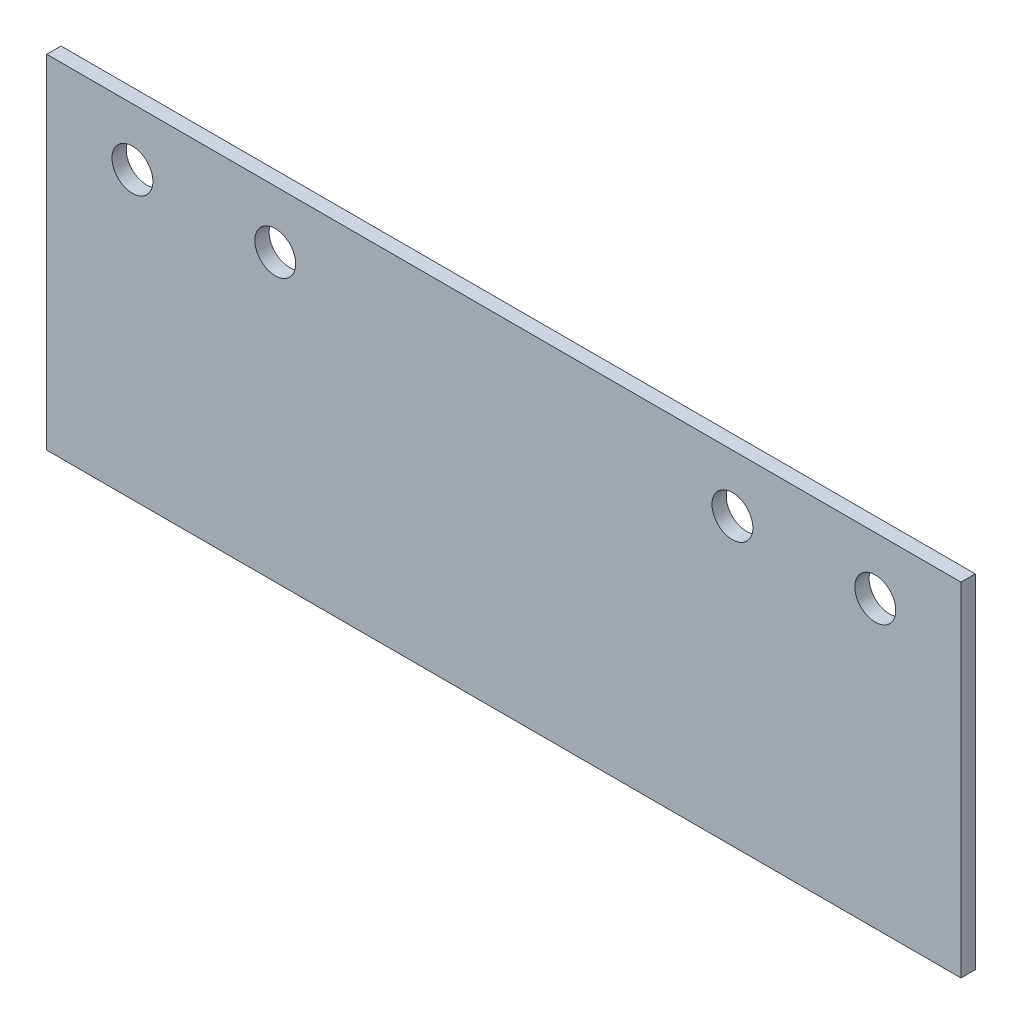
from build123d import *

# Parameters (mm, degrees)
SKETCH1_W                = 203.2
SKETCH1_H                = 76.2
BOSS_EXTRUDE1_DEPTH      = 3.175
T_0_358_DIAMETER_HOLE1_D = 9.0932


with BuildPart() as part:
    # Sketch1 → Boss-Extrude1 (new body)
    with BuildSketch(Plane.XY):
        with Locations((101.6, 38.1)):
            Rectangle(SKETCH1_W, SKETCH1_H)
    extrude(amount=BOSS_EXTRUDE1_DEPTH)

    # T _0.358_ Diameter Hole1 (through all)
    with Locations(Plane.XY.offset(3.175)):
        with Locations((184.15, 63.5), (19.05, 63.5), (152.4, 63.5), (50.8, 63.5)):
            Hole(T_0_358_DIAMETER_HOLE1_D / 2)


solid = part.part
